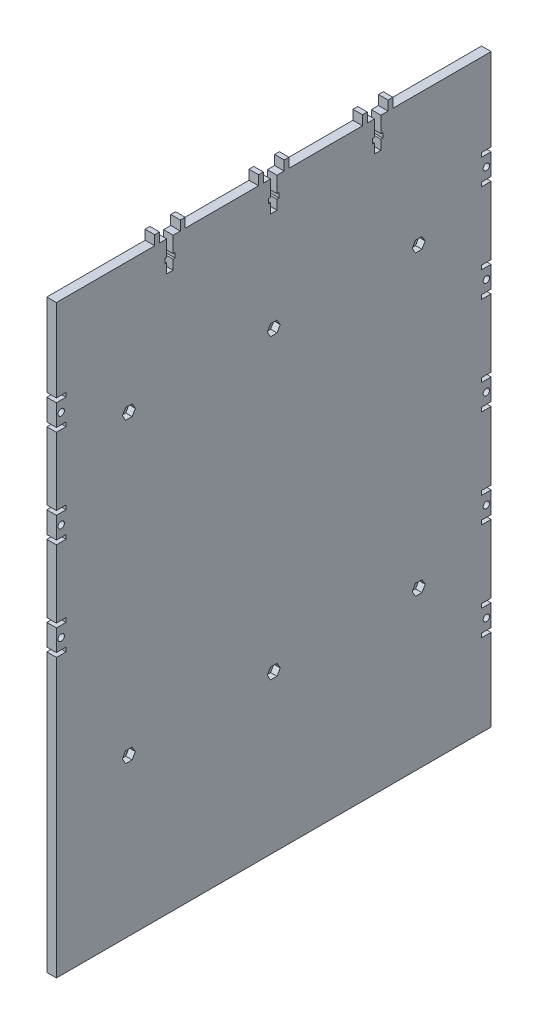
from build123d import *

# Parameters (mm, degrees)
SKETCH1_W           = 272
SKETCH1_H           = 366
BOSS_EXTRUDE1_DEPTH = 6
CUT_EXTRUDE1_DEPTH  = 229.081125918
SKETCH3_W           = 3
SKETCH3_H           = 6
BOSS_EXTRUDE2_DEPTH = 6
LPATTERN1_COUNT     = 3
LPATTERN1_PITCH     = 65
SKETCH4_R           = 2
SKETCH4_W           = 6
SKETCH4_H           = 2.6
CUT_EXTRUDE2_DEPTH  = 233.92273397
SKETCH7_R           = 2
CUT_EXTRUDE5_DEPTH  = 233.92273397
CUT_EXTRUDE6_DEPTH  = 4


with BuildPart() as part:
    # Sketch1 → Boss-Extrude1 (new body)
    with BuildSketch(Plane(origin=(0, 0, 0), x_dir=(0, 0, -1), z_dir=(1, 0, 0))):
        Rectangle(SKETCH1_W, SKETCH1_H)
    extrude(amount=BOSS_EXTRUDE1_DEPTH)

    # Sketch2 → Cut-Extrude1 (cut, through all)
    with BuildSketch(Plane(origin=(6, 0, 0), x_dir=(0, 0, -1), z_dir=(1, 0, 0))):
        Polygon((-67, 183), (-63, 183), (-63, 173), (-61.8, 173), (-61.8, 170), (-63, 170), (-63, 164), (-67, 164), (-67, 170), (-68.2, 170), (-68.2, 173), (-67, 173), align=None)
    cut_extrude1 = extrude(amount=-CUT_EXTRUDE1_DEPTH, mode=Mode.SUBTRACT)

    # Sketch3 → Boss-Extrude2 (add, through all)
    with BuildSketch(Plane(origin=(6, 0, 0), x_dir=(0, 0, -1), z_dir=(1, 0, 0))):
        with Locations((-73, 186)):
            Rectangle(SKETCH3_W, SKETCH3_H)
        with Locations((-57, 186)):
            Rectangle(SKETCH3_W, SKETCH3_H)
    boss_extrude2 = extrude(amount=-BOSS_EXTRUDE2_DEPTH)

    # LPattern1: Cut-Extrude1, Boss-Extrude2 ×3
    with Locations(*[(0, 0, -i * LPATTERN1_PITCH) for i in range(1, LPATTERN1_COUNT)]):
        add(cut_extrude1, mode=Mode.SUBTRACT)
        add(boss_extrude2)

    # Sketch4 → Cut-Extrude2 (cut, through all)
    with BuildSketch(Plane(origin=(6, 0, 0), x_dir=(0, 0, -1), z_dir=(1, 0, 0))):
        with Locations((-133, 122)):
            Circle(SKETCH4_R)
        with Locations((-133, 61)):
            Circle(SKETCH4_R)
        with Locations((-133, 0)):
            Circle(SKETCH4_R)
        with Locations(Location((133, -122.4, 0), (0, 0, 180))):
            Circle(SKETCH4_R)
        with Locations(Location((133, -61.2, 0), (0, 0, 180))):
            Circle(SKETCH4_R)
        with Locations(Location((133, 0, 0), (0, 0, 180))):
            Circle(SKETCH4_R)
        with Locations(Location((133, 61, 0), (0, 0, 180))):
            Circle(SKETCH4_R)
        with Locations(Location((133, 122, 0), (0, 0, 180))):
            Circle(SKETCH4_R)
        with Locations((-133, 114)):
            Rectangle(SKETCH4_W, SKETCH4_H)
        with Locations((-133, 130)):
            Rectangle(SKETCH4_W, SKETCH4_H)
        with Locations((-133, 69)):
            Rectangle(SKETCH4_W, SKETCH4_H)
        with Locations((-133, 53)):
            Rectangle(SKETCH4_W, SKETCH4_H)
        with Locations((-133, 8)):
            Rectangle(SKETCH4_W, SKETCH4_H)
        with Locations((-133, -8)):
            Rectangle(SKETCH4_W, SKETCH4_H)
        with Locations((133, -130.4)):
            Rectangle(SKETCH4_W, SKETCH4_H)
        with Locations((133, -114.4)):
            Rectangle(SKETCH4_W, SKETCH4_H)
        with Locations((133, -69.2)):
            Rectangle(SKETCH4_W, SKETCH4_H)
        with Locations((133, -53.2)):
            Rectangle(SKETCH4_W, SKETCH4_H)
        with Locations((133, -8)):
            Rectangle(SKETCH4_W, SKETCH4_H)
        with Locations((133, 8)):
            Rectangle(SKETCH4_W, SKETCH4_H)
        with Locations((133, 53)):
            Rectangle(SKETCH4_W, SKETCH4_H)
        with Locations((133, 69)):
            Rectangle(SKETCH4_W, SKETCH4_H)
        with Locations((133, 114)):
            Rectangle(SKETCH4_W, SKETCH4_H)
        with Locations((133, 130)):
            Rectangle(SKETCH4_W, SKETCH4_H)
    extrude(amount=-CUT_EXTRUDE2_DEPTH, mode=Mode.SUBTRACT)

    # Sketch7 → Cut-Extrude5 (cut, through all)
    with BuildSketch(Plane(origin=(6, 0, 0), x_dir=(0, 0, -1), z_dir=(1, 0, 0))):
        with Locations((-90.666666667, -85)):
            Circle(SKETCH7_R)
        with Locations((-90.666666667, 101)):
            Circle(SKETCH7_R)
        with Locations((0, 101)):
            Circle(SKETCH7_R)
        with Locations((0, -85)):
            Circle(SKETCH7_R)
        with Locations((90.666666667, 101)):
            Circle(SKETCH7_R)
        with Locations((90.666666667, -85)):
            Circle(SKETCH7_R)
    extrude(amount=-CUT_EXTRUDE5_DEPTH, mode=Mode.SUBTRACT)

    # Sketch8 → Cut-Extrude6 (cut)
    with BuildSketch(Plane(origin=(6, 0, 0), x_dir=(0, 0, -1), z_dir=(1, 0, 0))):
        Polygon((-94.708118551, 101), (-92.687392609, 97.5), (-88.645940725, 97.5), (-86.625214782, 101), (-88.645940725, 104.5), (-92.687392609, 104.5), align=None)
        Polygon((-4.041451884, 101), (-2.020725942, 97.5), (2.020725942, 97.5), (4.041451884, 101), (2.020725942, 104.5), (-2.020725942, 104.5), align=None)
        Polygon((86.625214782, 101), (88.645940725, 97.5), (92.687392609, 97.5), (94.708118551, 101), (92.687392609, 104.5), (88.645940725, 104.5), align=None)
        Polygon((86.625214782, -85), (88.645940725, -88.5), (92.687392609, -88.5), (94.708118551, -85), (92.687392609, -81.5), (88.645940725, -81.5), align=None)
        Polygon((-2.020725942, -81.5), (-4.041451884, -85), (-2.020725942, -88.5), (2.020725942, -88.5), (4.041451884, -85), (2.020725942, -81.5), align=None)
        Polygon((-92.687392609, -81.5), (-94.708118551, -85), (-92.687392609, -88.5), (-88.645940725, -88.5), (-86.625214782, -85), (-88.645940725, -81.5), align=None)
    extrude(amount=-CUT_EXTRUDE6_DEPTH, mode=Mode.SUBTRACT)


solid = part.part
